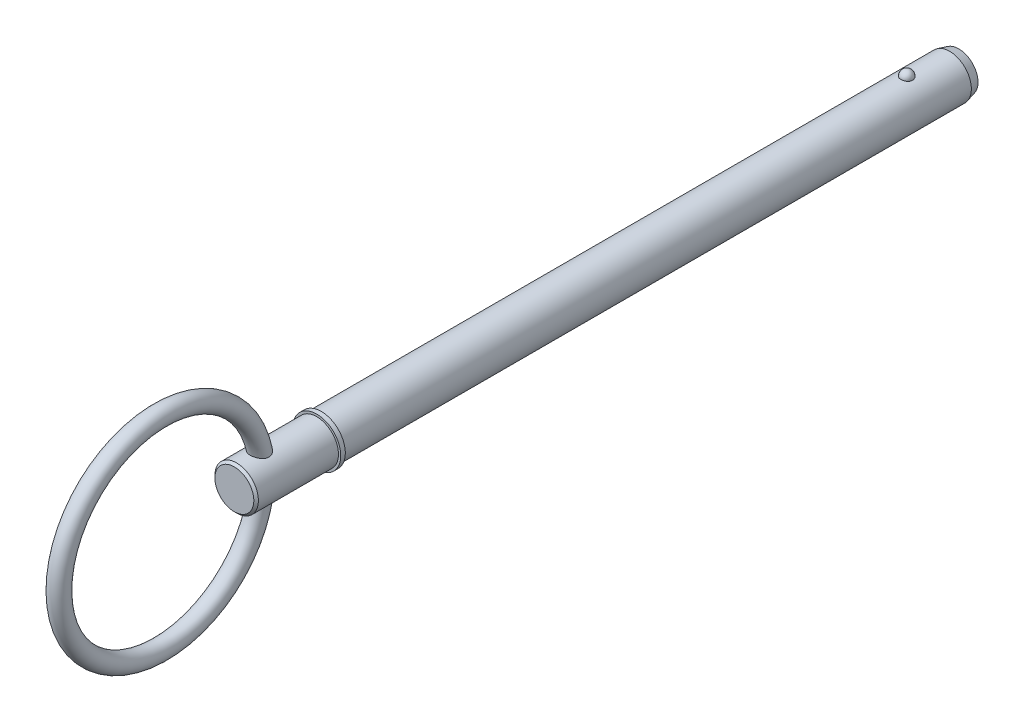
from build123d import *

# Parameters (mm, degrees)
SKETCH2_R           = 4.765
BOSS_EXTRUDE1_DEPTH = 127
BOSS_EXTRUDE2_START = 12.7
SKETCH3_R           = 4.765
BOSS_EXTRUDE2_DEPTH = 12.7
CHAMFER1_SIZE       = 2
CHAMFER1_SIZE2      = 0.535898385
SKETCH20_W          = 1
SKETCH20_H          = 5.265
SKETCH21_R          = 4.765
BOSS_EXTRUDE3_DEPTH = 19.05
CHAMFER2_SIZE       = 0.5
SKETCH24_R          = 2


with BuildPart() as part:
    # Sketch2 → Boss-Extrude1 (new body)
    with BuildSketch(Plane.XY):
        Circle(SKETCH2_R)
    extrude(amount=BOSS_EXTRUDE1_DEPTH)

    # Sketch3 → Boss-Extrude2 (add)
    with BuildSketch(Plane(origin=(0, 0, 0), x_dir=(-1, 0, 0), z_dir=(0, 0, -1)).offset(BOSS_EXTRUDE2_START)):
        Circle(SKETCH3_R)
    extrude(amount=-BOSS_EXTRUDE2_DEPTH)

    # Chamfer1
    chamfer1_edges = [part.edges().sort_by_distance(p)[0] for p in [
        (4.765, 0, -12.7),
    ]]
    chamfer1_side = [part.faces().sort_by_distance(p)[0] for p in [
        (4.765, 0, -6.35),
    ]]
    chamfer(chamfer1_edges, length=CHAMFER1_SIZE, length2=CHAMFER1_SIZE2, reference=chamfer1_side[0])

    # Sketch18 → Revolve1 (revolve)
    with BuildSketch(Plane(origin=(0, 0, 0), x_dir=(0, 0, -1), z_dir=(1, 0, 0))):
        with BuildLine():
            Line((1.29, 6.055), (1.29, 3.475))
            ThreePointArc((1.29, 3.475), (0, 4.765), (1.29, 6.055))
        make_face()
    revolve(axis=Axis((0, 6.055, -1.29), (0, -1, 0)))

    # Sketch20 → Revolve2 (revolve)
    with BuildSketch(Plane(origin=(0, 0, 0), x_dir=(0, 0, -1), z_dir=(1, 0, 0)), mode=Mode.PRIVATE) as revolve2_sk:
        with Locations((-127.5, 2.6325)):
            Rectangle(SKETCH20_W, SKETCH20_H)
    revolve(revolve2_sk.sketch.rotate(Axis((0, 0, 33.728787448), (0, 0, 1)), 90), axis=Axis((0, 0, 33.728787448), (0, 0, 1)))

    # Sketch21 → Boss-Extrude3 (add)
    with BuildSketch(Plane(origin=(0, 0, 127), x_dir=(-1, 0, 0), z_dir=(0, 0, -1))):
        Circle(SKETCH21_R)
    extrude(amount=-BOSS_EXTRUDE3_DEPTH)

    # Chamfer2
    chamfer2_edges = [part.edges().sort_by_distance(p)[0] for p in [
        (4.765, 0, 146.05),
    ]]
    chamfer(chamfer2_edges, length=CHAMFER2_SIZE)

    # Sweep1: sweep along a path in Sketch23
    with BuildLine(Plane(origin=(0, 0, 0), x_dir=(0, 0, -1), z_dir=(1, 0, 0))) as sweep1_path:
        CenterArc((-162.275, 0), 22.225, 0, 360)
    # Sketch24 → Sweep1 (sweep)
    with BuildSketch(Plane(origin=(0, 0, 0), x_dir=(1, 0, 0), z_dir=(0, 1, 0))):
        with Locations((0, -140.05)):
            Circle(SKETCH24_R)
    sweep(path=sweep1_path.line)


solid = part.part
